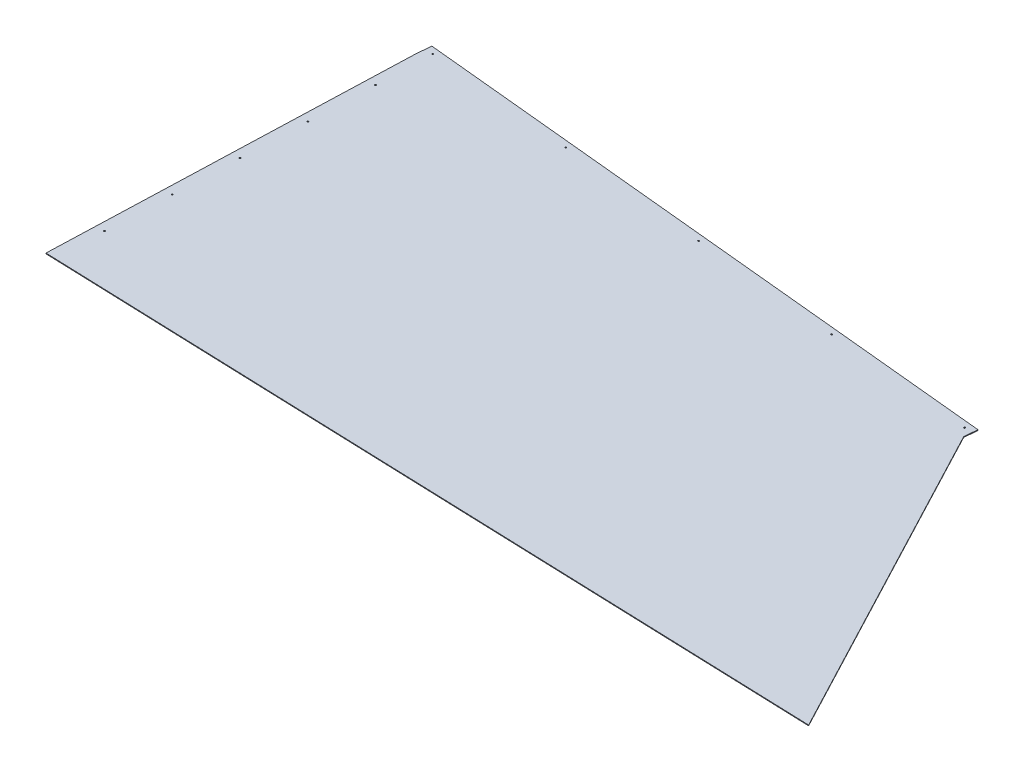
ISO-10303-21;
HEADER;
FILE_DESCRIPTION(('STEP AP214'),'2;1');
FILE_NAME('part.step','',(''),(''),'','','');
FILE_SCHEMA(('AUTOMOTIVE_DESIGN { 1 0 10303 214 1 1 1 1 }'));
ENDSEC;
DATA;
#1=APPLICATION_CONTEXT('core data for automotive mechanical design processes');
#2=APPLICATION_PROTOCOL_DEFINITION('international standard','automotive_design',2000,#1);
#3=PRODUCT_CONTEXT('',#1,'mechanical');
#4=PRODUCT('Part','Part','',(#3));
#5=PRODUCT_RELATED_PRODUCT_CATEGORY('part','',(#4));
#6=PRODUCT_DEFINITION_FORMATION('','',#4);
#7=PRODUCT_DEFINITION_CONTEXT('part definition',#1,'design');
#8=PRODUCT_DEFINITION('design','',#6,#7);
#9=PRODUCT_DEFINITION_SHAPE('','',#8);
#10=(LENGTH_UNIT() NAMED_UNIT(*) SI_UNIT(.MILLI.,.METRE.));
#11=(NAMED_UNIT(*) PLANE_ANGLE_UNIT() SI_UNIT($,.RADIAN.));
#12=(NAMED_UNIT(*) SI_UNIT($,.STERADIAN.) SOLID_ANGLE_UNIT());
#13=UNCERTAINTY_MEASURE_WITH_UNIT(LENGTH_MEASURE(1.E-05),#10,'distance_accuracy_value','');
#14=(GEOMETRIC_REPRESENTATION_CONTEXT(3) GLOBAL_UNCERTAINTY_ASSIGNED_CONTEXT((#13)) GLOBAL_UNIT_ASSIGNED_CONTEXT((#10,
#11,#12)) REPRESENTATION_CONTEXT('',''));
#15=CARTESIAN_POINT('',(0.,0.,0.));
#16=DIRECTION('',(0.,0.,1.));
#17=DIRECTION('',(1.,0.,0.));
#18=AXIS2_PLACEMENT_3D('',#15,#16,#17);
#19=CARTESIAN_POINT('',(828.090691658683,-2.53999999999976,-1276.24917351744));
#20=DIRECTION('',(0.,1.,0.));
#21=DIRECTION('',(-0.995256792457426,0.,-0.0972826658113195));
#22=AXIS2_PLACEMENT_3D('',#19,#20,#21);
#23=CYLINDRICAL_SURFACE('',#22,1.58749999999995);
#24=CARTESIAN_POINT('',(828.090691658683,2.22044604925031E-13,-1276.24917351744));
#25=DIRECTION('',(0.,1.,0.));
#26=DIRECTION('',(-0.995256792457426,0.,-0.0972826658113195));
#27=AXIS2_PLACEMENT_3D('',#24,#25,#26);
#28=CIRCLE('',#27,1.58749999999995);
#29=CARTESIAN_POINT('',(826.510721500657,2.24203641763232E-13,-1276.40360974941));
#30=VERTEX_POINT('',#29);
#31=EDGE_CURVE('E198',#30,#30,#28,.T.);
#32=ORIENTED_EDGE('',*,*,#31,.T.);
#33=EDGE_LOOP('',(#32));
#34=FACE_BOUND('',#33,.T.);
#35=CARTESIAN_POINT('',(828.090691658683,-1.62559999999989,-1276.24917351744));
#36=DIRECTION('',(0.,1.,0.));
#37=DIRECTION('',(-0.995256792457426,0.,-0.0972826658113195));
#38=AXIS2_PLACEMENT_3D('',#35,#36,#37);
#39=CIRCLE('',#38,1.58749999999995);
#40=CARTESIAN_POINT('',(826.510721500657,-1.62559999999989,-1276.40360974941));
#41=VERTEX_POINT('',#40);
#42=EDGE_CURVE('E109',#41,#41,#39,.T.);
#43=ORIENTED_EDGE('',*,*,#42,.F.);
#44=EDGE_LOOP('',(#43));
#45=FACE_BOUND('',#44,.T.);
#46=ADVANCED_FACE('F99',(#34,#45),#23,.F.);
#47=CARTESIAN_POINT('',(1156.72448452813,-2.54000000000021,-1244.12643726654));
#48=DIRECTION('',(0.,1.,0.));
#49=DIRECTION('',(-0.995256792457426,0.,-0.0972826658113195));
#50=AXIS2_PLACEMENT_3D('',#47,#48,#49);
#51=CYLINDRICAL_SURFACE('',#50,1.58750000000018);
#52=CARTESIAN_POINT('',(1156.72448452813,-2.22044604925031E-13,-1244.12643726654));
#53=DIRECTION('',(0.,1.,0.));
#54=DIRECTION('',(-0.995256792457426,0.,-0.0972826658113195));
#55=AXIS2_PLACEMENT_3D('',#52,#53,#54);
#56=CIRCLE('',#55,1.58750000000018);
#57=CARTESIAN_POINT('',(1155.1445143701,-2.1988556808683E-13,-1244.28087349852));
#58=VERTEX_POINT('',#57);
#59=EDGE_CURVE('E234',#58,#58,#56,.T.);
#60=ORIENTED_EDGE('',*,*,#59,.T.);
#61=EDGE_LOOP('',(#60));
#62=FACE_BOUND('',#61,.T.);
#63=CARTESIAN_POINT('',(1156.72448452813,-1.62560000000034,-1244.12643726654));
#64=DIRECTION('',(0.,1.,0.));
#65=DIRECTION('',(-0.995256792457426,0.,-0.0972826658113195));
#66=AXIS2_PLACEMENT_3D('',#63,#64,#65);
#67=CIRCLE('',#66,1.58750000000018);
#68=CARTESIAN_POINT('',(1155.1445143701,-1.62560000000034,-1244.28087349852));
#69=VERTEX_POINT('',#68);
#70=EDGE_CURVE('E203',#69,#69,#67,.T.);
#71=ORIENTED_EDGE('',*,*,#70,.F.);
#72=EDGE_LOOP('',(#71));
#73=FACE_BOUND('',#72,.T.);
#74=ADVANCED_FACE('F267',(#62,#73),#51,.F.);
#75=CARTESIAN_POINT('',(1485.35827739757,-2.54000000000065,-1212.00370101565));
#76=DIRECTION('',(0.,1.,0.));
#77=DIRECTION('',(-0.995256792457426,0.,-0.0972826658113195));
#78=AXIS2_PLACEMENT_3D('',#75,#76,#77);
#79=CYLINDRICAL_SURFACE('',#78,1.58749999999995);
#80=CARTESIAN_POINT('',(1485.35827739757,-4.44089209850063E-13,-1212.00370101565));
#81=DIRECTION('',(0.,1.,0.));
#82=DIRECTION('',(-0.995256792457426,0.,-0.0972826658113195));
#83=AXIS2_PLACEMENT_3D('',#80,#81,#82);
#84=CIRCLE('',#83,1.58749999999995);
#85=CARTESIAN_POINT('',(1483.77830723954,-4.41930173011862E-13,-1212.15813724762));
#86=VERTEX_POINT('',#85);
#87=EDGE_CURVE('E231',#86,#86,#84,.T.);
#88=ORIENTED_EDGE('',*,*,#87,.T.);
#89=EDGE_LOOP('',(#88));
#90=FACE_BOUND('',#89,.T.);
#91=CARTESIAN_POINT('',(1485.35827739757,-1.62560000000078,-1212.00370101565));
#92=DIRECTION('',(0.,1.,0.));
#93=DIRECTION('',(-0.995256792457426,0.,-0.0972826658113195));
#94=AXIS2_PLACEMENT_3D('',#91,#92,#93);
#95=CIRCLE('',#94,1.58749999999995);
#96=CARTESIAN_POINT('',(1483.77830723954,-1.62560000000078,-1212.15813724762));
#97=VERTEX_POINT('',#96);
#98=EDGE_CURVE('E206',#97,#97,#95,.T.);
#99=ORIENTED_EDGE('',*,*,#98,.F.);
#100=EDGE_LOOP('',(#99));
#101=FACE_BOUND('',#100,.T.);
#102=ADVANCED_FACE('F273',(#90,#101),#79,.F.);
#103=CARTESIAN_POINT('',(1813.99207026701,-2.54000000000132,-1179.88096476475));
#104=DIRECTION('',(0.,1.,0.));
#105=DIRECTION('',(-0.995256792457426,0.,-0.0972826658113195));
#106=AXIS2_PLACEMENT_3D('',#103,#104,#105);
#107=CYLINDRICAL_SURFACE('',#106,1.58749999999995);
#108=CARTESIAN_POINT('',(1813.99207026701,-1.33226762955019E-12,-1179.88096476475));
#109=DIRECTION('',(0.,1.,0.));
#110=DIRECTION('',(-0.995256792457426,0.,-0.0972826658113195));
#111=AXIS2_PLACEMENT_3D('',#108,#109,#110);
#112=CIRCLE('',#111,1.58749999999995);
#113=CARTESIAN_POINT('',(1812.41210010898,-1.33010859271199E-12,-1180.03540099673));
#114=VERTEX_POINT('',#113);
#115=EDGE_CURVE('E228',#114,#114,#112,.T.);
#116=ORIENTED_EDGE('',*,*,#115,.T.);
#117=EDGE_LOOP('',(#116));
#118=FACE_BOUND('',#117,.T.);
#119=CARTESIAN_POINT('',(1813.99207026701,-1.62560000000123,-1179.88096476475));
#120=DIRECTION('',(0.,1.,0.));
#121=DIRECTION('',(-0.995256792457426,0.,-0.0972826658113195));
#122=AXIS2_PLACEMENT_3D('',#119,#120,#121);
#123=CIRCLE('',#122,1.58749999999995);
#124=CARTESIAN_POINT('',(1812.41210010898,-1.62560000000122,-1180.03540099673));
#125=VERTEX_POINT('',#124);
#126=EDGE_CURVE('E209',#125,#125,#123,.T.);
#127=ORIENTED_EDGE('',*,*,#126,.F.);
#128=EDGE_LOOP('',(#127));
#129=FACE_BOUND('',#128,.T.);
#130=ADVANCED_FACE('F282',(#118,#129),#107,.F.);
#131=CARTESIAN_POINT('',(2142.62586313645,-2.54000000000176,-1147.75822851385));
#132=DIRECTION('',(0.,1.,0.));
#133=DIRECTION('',(-0.995256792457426,0.,-0.0972826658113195));
#134=AXIS2_PLACEMENT_3D('',#131,#132,#133);
#135=CYLINDRICAL_SURFACE('',#134,1.58750000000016);
#136=CARTESIAN_POINT('',(2142.62586313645,-1.99840144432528E-12,-1147.75822851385));
#137=DIRECTION('',(0.,1.,0.));
#138=DIRECTION('',(-0.995256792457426,0.,-0.0972826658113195));
#139=AXIS2_PLACEMENT_3D('',#136,#137,#138);
#140=CIRCLE('',#139,1.58750000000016);
#141=CARTESIAN_POINT('',(2141.04589297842,-1.99624240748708E-12,-1147.91266474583));
#142=VERTEX_POINT('',#141);
#143=EDGE_CURVE('E225',#142,#142,#140,.T.);
#144=ORIENTED_EDGE('',*,*,#143,.T.);
#145=EDGE_LOOP('',(#144));
#146=FACE_BOUND('',#145,.T.);
#147=CARTESIAN_POINT('',(2142.62586313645,-1.62560000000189,-1147.75822851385));
#148=DIRECTION('',(0.,1.,0.));
#149=DIRECTION('',(-0.995256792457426,0.,-0.0972826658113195));
#150=AXIS2_PLACEMENT_3D('',#147,#148,#149);
#151=CIRCLE('',#150,1.58750000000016);
#152=CARTESIAN_POINT('',(2141.04589297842,-1.62560000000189,-1147.91266474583));
#153=VERTEX_POINT('',#152);
#154=EDGE_CURVE('E212',#153,#153,#151,.T.);
#155=ORIENTED_EDGE('',*,*,#154,.F.);
#156=EDGE_LOOP('',(#155));
#157=FACE_BOUND('',#156,.T.);
#158=ADVANCED_FACE('F264',(#146,#157),#135,.F.);
#159=CARTESIAN_POINT('',(2192.56312068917,-2724.48951328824,-1155.63757233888));
#160=DIRECTION('',(0.0972826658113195,0.,-0.995256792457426));
#161=DIRECTION('',(-0.995256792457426,0.,-0.0972826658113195));
#162=AXIS2_PLACEMENT_3D('',#159,#160,#161);
#163=PLANE('',#162);
#164=DIRECTION('',(0.,1.,0.));
#165=VECTOR('',#164,1.);
#166=CARTESIAN_POINT('',(812.044790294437,-2724.48951328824,-1290.57812677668));
#167=LINE('',#166,#165);
#168=CARTESIAN_POINT('',(812.04479029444,-1.62559999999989,-1290.57812677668));
#169=VERTEX_POINT('',#168);
#170=CARTESIAN_POINT('',(812.04479029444,-4.44089209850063E-13,-1290.57812677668));
#171=VERTEX_POINT('',#170);
#172=EDGE_CURVE('E223',#169,#171,#167,.T.);
#173=ORIENTED_EDGE('',*,*,#172,.T.);
#174=DIRECTION('',(0.995256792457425,0.,0.0972826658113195));
#175=VECTOR('',#174,1.);
#176=CARTESIAN_POINT('',(2192.56312068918,-1.55431223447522E-12,-1155.63757233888));
#177=LINE('',#176,#175);
#178=CARTESIAN_POINT('',(2161.24102473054,-1.77635683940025E-12,-1158.69919122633));
#179=VERTEX_POINT('',#178);
#180=EDGE_CURVE('E221',#171,#179,#177,.T.);
#181=ORIENTED_EDGE('',*,*,#180,.T.);
#182=DIRECTION('',(0.,1.,0.));
#183=VECTOR('',#182,1.);
#184=CARTESIAN_POINT('',(2161.24102473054,-2724.48951328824,-1158.69919122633));
#185=LINE('',#184,#183);
#186=CARTESIAN_POINT('',(2161.24102473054,-1.62560000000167,-1158.69919122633));
#187=VERTEX_POINT('',#186);
#188=EDGE_CURVE('E128',#187,#179,#185,.T.);
#189=ORIENTED_EDGE('',*,*,#188,.F.);
#190=DIRECTION('',(-0.995256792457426,0.,-0.0972826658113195));
#191=VECTOR('',#190,1.);
#192=CARTESIAN_POINT('',(2192.56312068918,-1.62560000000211,-1155.63757233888));
#193=LINE('',#192,#191);
#194=EDGE_CURVE('E117',#187,#169,#193,.T.);
#195=ORIENTED_EDGE('',*,*,#194,.T.);
#196=EDGE_LOOP('',(#173,#181,#189,#195));
#197=FACE_BOUND('',#196,.T.);
#198=ADVANCED_FACE('F255',(#197),#163,.T.);
#199=CARTESIAN_POINT('',(808.956065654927,-2724.48951328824,-1258.97872361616));
#200=DIRECTION('',(0.995256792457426,0.,0.0972826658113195));
#201=DIRECTION('',(0.0972826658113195,0.,-0.995256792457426));
#202=AXIS2_PLACEMENT_3D('',#199,#200,#201);
#203=PLANE('',#202);
#204=DIRECTION('',(-0.0972826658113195,0.,0.995256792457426));
#205=VECTOR('',#204,1.);
#206=CARTESIAN_POINT('',(808.956065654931,-2.22044604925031E-13,-1258.97872361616));
#207=LINE('',#206,#205);
#208=CARTESIAN_POINT('',(809.057878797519,-1.15142270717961E-13,-1260.02032975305));
#209=VERTEX_POINT('',#208);
#210=EDGE_CURVE('E136',#171,#209,#207,.T.);
#211=ORIENTED_EDGE('',*,*,#210,.F.);
#212=ORIENTED_EDGE('',*,*,#172,.F.);
#213=DIRECTION('',(0.0972826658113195,0.,-0.995256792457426));
#214=VECTOR('',#213,1.);
#215=CARTESIAN_POINT('',(808.956065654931,-1.62560000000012,-1258.97872361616));
#216=LINE('',#215,#214);
#217=CARTESIAN_POINT('',(809.057878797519,-1.62560000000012,-1260.02032975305));
#218=VERTEX_POINT('',#217);
#219=EDGE_CURVE('E13',#218,#169,#216,.T.);
#220=ORIENTED_EDGE('',*,*,#219,.F.);
#221=DIRECTION('',(0.,-1.,0.));
#222=VECTOR('',#221,1.);
#223=CARTESIAN_POINT('',(809.057878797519,-0.812800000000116,-1260.02032975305));
#224=LINE('',#223,#222);
#225=EDGE_CURVE('E174',#209,#218,#224,.T.);
#226=ORIENTED_EDGE('',*,*,#225,.F.);
#227=EDGE_LOOP('',(#211,#212,#220,#226));
#228=FACE_BOUND('',#227,.T.);
#229=ADVANCED_FACE('F256',(#228),#203,.F.);
#230=CARTESIAN_POINT('',(129.55176663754,8.88178419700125E-13,-1325.38797786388));
#231=DIRECTION('',(0.,1.,0.));
#232=DIRECTION('',(-0.995256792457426,0.,-0.0972826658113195));
#233=AXIS2_PLACEMENT_3D('',#230,#231,#232);
#234=PLANE('',#233);
#235=ORIENTED_EDGE('',*,*,#210,.T.);
#236=DIRECTION('',(0.0347389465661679,0.,-0.999396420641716));
#237=VECTOR('',#236,1.);
#238=CARTESIAN_POINT('',(809.001296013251,-1.14708589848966E-13,-1258.39251320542));
#239=LINE('',#238,#237);
#240=CARTESIAN_POINT('',(781.286136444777,0.,-461.061735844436));
#241=VERTEX_POINT('',#240);
#242=EDGE_CURVE('E184',#241,#209,#239,.T.);
#243=ORIENTED_EDGE('',*,*,#242,.F.);
#244=DIRECTION('',(0.999396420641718,0.,0.0347389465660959));
#245=VECTOR('',#244,1.);
#246=CARTESIAN_POINT('',(2571.71966629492,0.,-398.82639715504));
#247=LINE('',#246,#245);
#248=CARTESIAN_POINT('',(2542.48326093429,0.,-399.842652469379));
#249=VERTEX_POINT('',#248);
#250=EDGE_CURVE('E183',#241,#249,#247,.T.);
#251=ORIENTED_EDGE('',*,*,#250,.T.);
#252=DIRECTION('',(0.46565562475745,0.,0.884966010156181));
#253=VECTOR('',#252,1.);
#254=CARTESIAN_POINT('',(2158.41225593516,-1.08203376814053E-13,-1129.75928364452));
#255=LINE('',#254,#253);
#256=CARTESIAN_POINT('',(2158.41225593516,-1.0842021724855E-13,-1129.75928364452));
#257=VERTEX_POINT('',#256);
#258=EDGE_CURVE('E158',#257,#249,#255,.T.);
#259=ORIENTED_EDGE('',*,*,#258,.F.);
#260=DIRECTION('',(-0.0972826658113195,0.,0.995256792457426));
#261=VECTOR('',#260,1.);
#262=CARTESIAN_POINT('',(2158.15230009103,-1.99840144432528E-12,-1127.09978806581));
#263=LINE('',#262,#261);
#264=EDGE_CURVE('E217',#179,#257,#263,.T.);
#265=ORIENTED_EDGE('',*,*,#264,.F.);
#266=ORIENTED_EDGE('',*,*,#180,.F.);
#267=EDGE_LOOP('',(#235,#243,#251,#259,#265,#266));
#268=FACE_BOUND('',#267,.T.);
#269=ORIENTED_EDGE('',*,*,#143,.F.);
#270=EDGE_LOOP('',(#269));
#271=FACE_BOUND('',#270,.T.);
#272=ORIENTED_EDGE('',*,*,#115,.F.);
#273=EDGE_LOOP('',(#272));
#274=FACE_BOUND('',#273,.T.);
#275=ORIENTED_EDGE('',*,*,#87,.F.);
#276=EDGE_LOOP('',(#275));
#277=FACE_BOUND('',#276,.T.);
#278=ORIENTED_EDGE('',*,*,#59,.F.);
#279=EDGE_LOOP('',(#278));
#280=FACE_BOUND('',#279,.T.);
#281=ORIENTED_EDGE('',*,*,#31,.F.);
#282=EDGE_LOOP('',(#281));
#283=FACE_BOUND('',#282,.T.);
#284=CARTESIAN_POINT('',(804.091554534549,0.,-568.769469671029));
#285=DIRECTION('',(0.,1.,0.));
#286=DIRECTION('',(-1.,0.,0.));
#287=AXIS2_PLACEMENT_3D('',#284,#285,#286);
#288=CIRCLE('',#287,1.58749999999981);
#289=CARTESIAN_POINT('',(802.50405453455,0.,-568.769469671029));
#290=VERTEX_POINT('',#289);
#291=EDGE_CURVE('E527',#290,#290,#288,.F.);
#292=ORIENTED_EDGE('',*,*,#291,.T.);
#293=EDGE_LOOP('',(#292));
#294=FACE_BOUND('',#293,.T.);
#295=CARTESIAN_POINT('',(809.165177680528,0.,-714.731316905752));
#296=DIRECTION('',(0.,1.,0.));
#297=DIRECTION('',(-1.,0.,0.));
#298=AXIS2_PLACEMENT_3D('',#295,#296,#297);
#299=CIRCLE('',#298,1.58749999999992);
#300=CARTESIAN_POINT('',(807.577677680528,0.,-714.731316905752));
#301=VERTEX_POINT('',#300);
#302=EDGE_CURVE('E524',#301,#301,#299,.F.);
#303=ORIENTED_EDGE('',*,*,#302,.T.);
#304=EDGE_LOOP('',(#303));
#305=FACE_BOUND('',#304,.T.);
#306=CARTESIAN_POINT('',(814.238800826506,0.,-860.693164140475));
#307=DIRECTION('',(0.,1.,0.));
#308=DIRECTION('',(-1.,0.,0.));
#309=AXIS2_PLACEMENT_3D('',#306,#307,#308);
#310=CIRCLE('',#309,1.58749999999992);
#311=CARTESIAN_POINT('',(812.651300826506,0.,-860.693164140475));
#312=VERTEX_POINT('',#311);
#313=EDGE_CURVE('E519',#312,#312,#310,.F.);
#314=ORIENTED_EDGE('',*,*,#313,.T.);
#315=EDGE_LOOP('',(#314));
#316=FACE_BOUND('',#315,.T.);
#317=CARTESIAN_POINT('',(819.312423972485,0.,-1006.6550113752));
#318=DIRECTION('',(0.,1.,0.));
#319=DIRECTION('',(-1.,0.,0.));
#320=AXIS2_PLACEMENT_3D('',#317,#318,#319);
#321=CIRCLE('',#320,1.58749999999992);
#322=CARTESIAN_POINT('',(817.724923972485,0.,-1006.6550113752));
#323=VERTEX_POINT('',#322);
#324=EDGE_CURVE('E516',#323,#323,#321,.F.);
#325=ORIENTED_EDGE('',*,*,#324,.T.);
#326=EDGE_LOOP('',(#325));
#327=FACE_BOUND('',#326,.T.);
#328=CARTESIAN_POINT('',(824.386047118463,0.,-1152.61685860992));
#329=DIRECTION('',(0.,1.,0.));
#330=DIRECTION('',(-1.,0.,0.));
#331=AXIS2_PLACEMENT_3D('',#328,#329,#330);
#332=CIRCLE('',#331,1.5874999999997);
#333=CARTESIAN_POINT('',(822.798547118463,0.,-1152.61685860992));
#334=VERTEX_POINT('',#333);
#335=EDGE_CURVE('E250',#334,#334,#332,.F.);
#336=ORIENTED_EDGE('',*,*,#335,.T.);
#337=EDGE_LOOP('',(#336));
#338=FACE_BOUND('',#337,.T.);
#339=ADVANCED_FACE('F247',(#268,#271,#274,#277,#280,#283,#294,#305,#316,#327,#338),#234,.T.);
#340=CARTESIAN_POINT('',(2158.15230009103,-2724.48951328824,-1127.09978806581));
#341=DIRECTION('',(-0.995256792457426,0.,-0.0972826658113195));
#342=DIRECTION('',(-0.0972826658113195,0.,0.995256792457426));
#343=AXIS2_PLACEMENT_3D('',#340,#341,#342);
#344=PLANE('',#343);
#345=ORIENTED_EDGE('',*,*,#264,.T.);
#346=DIRECTION('',(0.,-1.,0.));
#347=VECTOR('',#346,1.);
#348=CARTESIAN_POINT('',(2158.41225593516,-0.812800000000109,-1129.75928364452));
#349=LINE('',#348,#347);
#350=CARTESIAN_POINT('',(2158.41225593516,-1.62560000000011,-1129.75928364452));
#351=VERTEX_POINT('',#350);
#352=EDGE_CURVE('E199',#257,#351,#349,.T.);
#353=ORIENTED_EDGE('',*,*,#352,.T.);
#354=DIRECTION('',(0.0972826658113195,0.,-0.995256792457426));
#355=VECTOR('',#354,1.);
#356=CARTESIAN_POINT('',(2158.15230009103,-1.62560000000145,-1127.09978806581));
#357=LINE('',#356,#355);
#358=EDGE_CURVE('E141',#351,#187,#357,.T.);
#359=ORIENTED_EDGE('',*,*,#358,.T.);
#360=ORIENTED_EDGE('',*,*,#188,.T.);
#361=EDGE_LOOP('',(#345,#353,#359,#360));
#362=FACE_BOUND('',#361,.T.);
#363=ADVANCED_FACE('F253',(#362),#344,.F.);
#364=CARTESIAN_POINT('',(0.,-1.6256,0.));
#365=DIRECTION('',(0.,1.,0.));
#366=DIRECTION('',(-1.,0.,0.));
#367=AXIS2_PLACEMENT_3D('',#364,#365,#366);
#368=PLANE('',#367);
#369=ORIENTED_EDGE('',*,*,#154,.T.);
#370=EDGE_LOOP('',(#369));
#371=FACE_BOUND('',#370,.T.);
#372=ORIENTED_EDGE('',*,*,#126,.T.);
#373=EDGE_LOOP('',(#372));
#374=FACE_BOUND('',#373,.T.);
#375=ORIENTED_EDGE('',*,*,#98,.T.);
#376=EDGE_LOOP('',(#375));
#377=FACE_BOUND('',#376,.T.);
#378=ORIENTED_EDGE('',*,*,#70,.T.);
#379=EDGE_LOOP('',(#378));
#380=FACE_BOUND('',#379,.T.);
#381=ORIENTED_EDGE('',*,*,#42,.T.);
#382=EDGE_LOOP('',(#381));
#383=FACE_BOUND('',#382,.T.);
#384=ORIENTED_EDGE('',*,*,#358,.F.);
#385=DIRECTION('',(0.46565562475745,0.,0.884966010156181));
#386=VECTOR('',#385,1.);
#387=CARTESIAN_POINT('',(2158.41225593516,-1.62560000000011,-1129.75928364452));
#388=LINE('',#387,#386);
#389=CARTESIAN_POINT('',(2542.48326093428,-1.62560000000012,-399.842652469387));
#390=VERTEX_POINT('',#389);
#391=EDGE_CURVE('E176',#351,#390,#388,.T.);
#392=ORIENTED_EDGE('',*,*,#391,.T.);
#393=DIRECTION('',(0.999396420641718,0.,0.0347389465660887));
#394=VECTOR('',#393,1.);
#395=CARTESIAN_POINT('',(-2552.7,-1.62560000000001,-576.950850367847));
#396=LINE('',#395,#394);
#397=CARTESIAN_POINT('',(781.286136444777,-1.6256,-461.061735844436));
#398=VERTEX_POINT('',#397);
#399=EDGE_CURVE('E182',#398,#390,#396,.T.);
#400=ORIENTED_EDGE('',*,*,#399,.F.);
#401=DIRECTION('',(0.0347389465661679,0.,-0.999396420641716));
#402=VECTOR('',#401,1.);
#403=CARTESIAN_POINT('',(809.001296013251,-1.62560000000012,-1258.39251320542));
#404=LINE('',#403,#402);
#405=EDGE_CURVE('E169',#398,#218,#404,.T.);
#406=ORIENTED_EDGE('',*,*,#405,.T.);
#407=ORIENTED_EDGE('',*,*,#219,.T.);
#408=ORIENTED_EDGE('',*,*,#194,.F.);
#409=EDGE_LOOP('',(#384,#392,#400,#406,#407,#408));
#410=FACE_BOUND('',#409,.T.);
#411=CARTESIAN_POINT('',(824.386047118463,-1.6256,-1152.61685860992));
#412=DIRECTION('',(0.,-1.,0.));
#413=DIRECTION('',(1.,0.,0.));
#414=AXIS2_PLACEMENT_3D('',#411,#412,#413);
#415=CIRCLE('',#414,1.5874999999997);
#416=CARTESIAN_POINT('',(825.973547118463,-1.6256,-1152.61685860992));
#417=VERTEX_POINT('',#416);
#418=EDGE_CURVE('E512',#417,#417,#415,.T.);
#419=ORIENTED_EDGE('',*,*,#418,.F.);
#420=EDGE_LOOP('',(#419));
#421=FACE_BOUND('',#420,.T.);
#422=CARTESIAN_POINT('',(819.312423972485,-1.6256,-1006.6550113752));
#423=DIRECTION('',(0.,-1.,0.));
#424=DIRECTION('',(1.,0.,0.));
#425=AXIS2_PLACEMENT_3D('',#422,#423,#424);
#426=CIRCLE('',#425,1.58749999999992);
#427=CARTESIAN_POINT('',(820.899923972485,-1.6256,-1006.6550113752));
#428=VERTEX_POINT('',#427);
#429=EDGE_CURVE('E531',#428,#428,#426,.T.);
#430=ORIENTED_EDGE('',*,*,#429,.F.);
#431=EDGE_LOOP('',(#430));
#432=FACE_BOUND('',#431,.T.);
#433=CARTESIAN_POINT('',(814.238800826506,-1.6256,-860.693164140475));
#434=DIRECTION('',(0.,-1.,0.));
#435=DIRECTION('',(1.,0.,0.));
#436=AXIS2_PLACEMENT_3D('',#433,#434,#435);
#437=CIRCLE('',#436,1.58749999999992);
#438=CARTESIAN_POINT('',(815.826300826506,-1.6256,-860.693164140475));
#439=VERTEX_POINT('',#438);
#440=EDGE_CURVE('E534',#439,#439,#437,.T.);
#441=ORIENTED_EDGE('',*,*,#440,.F.);
#442=EDGE_LOOP('',(#441));
#443=FACE_BOUND('',#442,.T.);
#444=CARTESIAN_POINT('',(809.165177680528,-1.6256,-714.731316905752));
#445=DIRECTION('',(0.,-1.,0.));
#446=DIRECTION('',(1.,0.,0.));
#447=AXIS2_PLACEMENT_3D('',#444,#445,#446);
#448=CIRCLE('',#447,1.58749999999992);
#449=CARTESIAN_POINT('',(810.752677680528,-1.6256,-714.731316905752));
#450=VERTEX_POINT('',#449);
#451=EDGE_CURVE('E192',#450,#450,#448,.T.);
#452=ORIENTED_EDGE('',*,*,#451,.F.);
#453=EDGE_LOOP('',(#452));
#454=FACE_BOUND('',#453,.T.);
#455=CARTESIAN_POINT('',(804.091554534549,-1.6256,-568.769469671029));
#456=DIRECTION('',(0.,-1.,0.));
#457=DIRECTION('',(1.,0.,0.));
#458=AXIS2_PLACEMENT_3D('',#455,#456,#457);
#459=CIRCLE('',#458,1.58749999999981);
#460=CARTESIAN_POINT('',(805.679054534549,-1.6256,-568.769469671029));
#461=VERTEX_POINT('',#460);
#462=EDGE_CURVE('E188',#461,#461,#459,.T.);
#463=ORIENTED_EDGE('',*,*,#462,.F.);
#464=EDGE_LOOP('',(#463));
#465=FACE_BOUND('',#464,.T.);
#466=ADVANCED_FACE('F101',(#371,#374,#377,#380,#383,#410,#421,#432,#443,#454,#465),#368,.F.);
#467=CARTESIAN_POINT('',(809.001296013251,-0.812800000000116,-1258.39251320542));
#468=DIRECTION('',(-0.999396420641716,0.,-0.0347389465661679));
#469=DIRECTION('',(0.0347389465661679,0.,-0.999396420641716));
#470=AXIS2_PLACEMENT_3D('',#467,#468,#469);
#471=PLANE('',#470);
#472=ORIENTED_EDGE('',*,*,#405,.F.);
#473=DIRECTION('',(0.,1.,0.));
#474=VECTOR('',#473,1.);
#475=CARTESIAN_POINT('',(781.286136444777,-3920.25963480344,-461.061735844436));
#476=LINE('',#475,#474);
#477=EDGE_CURVE('E173',#398,#241,#476,.T.);
#478=ORIENTED_EDGE('',*,*,#477,.T.);
#479=ORIENTED_EDGE('',*,*,#242,.T.);
#480=ORIENTED_EDGE('',*,*,#225,.T.);
#481=EDGE_LOOP('',(#472,#478,#479,#480));
#482=FACE_BOUND('',#481,.T.);
#483=ADVANCED_FACE('F171',(#482),#471,.T.);
#484=CARTESIAN_POINT('',(2158.41225593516,-0.812800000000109,-1129.75928364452));
#485=DIRECTION('',(0.88496601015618,0.,-0.46565562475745));
#486=DIRECTION('',(0.46565562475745,0.,0.884966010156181));
#487=AXIS2_PLACEMENT_3D('',#484,#485,#486);
#488=PLANE('',#487);
#489=ORIENTED_EDGE('',*,*,#258,.T.);
#490=DIRECTION('',(0.,1.,0.));
#491=VECTOR('',#490,1.);
#492=CARTESIAN_POINT('',(2542.48326093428,-3920.25963480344,-399.842652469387));
#493=LINE('',#492,#491);
#494=EDGE_CURVE('E189',#390,#249,#493,.T.);
#495=ORIENTED_EDGE('',*,*,#494,.F.);
#496=ORIENTED_EDGE('',*,*,#391,.F.);
#497=ORIENTED_EDGE('',*,*,#352,.F.);
#498=EDGE_LOOP('',(#489,#495,#496,#497));
#499=FACE_BOUND('',#498,.T.);
#500=ADVANCED_FACE('F252',(#499),#488,.T.);
#501=CARTESIAN_POINT('',(-2552.7,-3920.25963480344,-576.950850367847));
#502=DIRECTION('',(-0.0347389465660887,0.,0.999396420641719));
#503=DIRECTION('',(0.999396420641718,0.,0.0347389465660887));
#504=AXIS2_PLACEMENT_3D('',#501,#502,#503);
#505=PLANE('',#504);
#506=ORIENTED_EDGE('',*,*,#494,.T.);
#507=ORIENTED_EDGE('',*,*,#250,.F.);
#508=ORIENTED_EDGE('',*,*,#477,.F.);
#509=ORIENTED_EDGE('',*,*,#399,.T.);
#510=EDGE_LOOP('',(#506,#507,#508,#509));
#511=FACE_BOUND('',#510,.T.);
#512=ADVANCED_FACE('F181',(#511),#505,.T.);
#513=CARTESIAN_POINT('',(804.091554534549,4.49012806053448,-568.769469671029));
#514=DIRECTION('',(0.,-1.,0.));
#515=DIRECTION('',(1.,0.,0.));
#516=AXIS2_PLACEMENT_3D('',#513,#514,#515);
#517=CYLINDRICAL_SURFACE('',#516,1.58749999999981);
#518=ORIENTED_EDGE('',*,*,#462,.T.);
#519=EDGE_LOOP('',(#518));
#520=FACE_BOUND('',#519,.T.);
#521=ORIENTED_EDGE('',*,*,#291,.F.);
#522=EDGE_LOOP('',(#521));
#523=FACE_BOUND('',#522,.T.);
#524=ADVANCED_FACE('F356',(#520,#523),#517,.F.);
#525=CARTESIAN_POINT('',(809.165177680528,4.49012806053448,-714.731316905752));
#526=DIRECTION('',(0.,-1.,0.));
#527=DIRECTION('',(1.,0.,0.));
#528=AXIS2_PLACEMENT_3D('',#525,#526,#527);
#529=CYLINDRICAL_SURFACE('',#528,1.58749999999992);
#530=ORIENTED_EDGE('',*,*,#451,.T.);
#531=EDGE_LOOP('',(#530));
#532=FACE_BOUND('',#531,.T.);
#533=ORIENTED_EDGE('',*,*,#302,.F.);
#534=EDGE_LOOP('',(#533));
#535=FACE_BOUND('',#534,.T.);
#536=ADVANCED_FACE('F363',(#532,#535),#529,.F.);
#537=CARTESIAN_POINT('',(814.238800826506,4.49012806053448,-860.693164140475));
#538=DIRECTION('',(0.,-1.,0.));
#539=DIRECTION('',(1.,0.,0.));
#540=AXIS2_PLACEMENT_3D('',#537,#538,#539);
#541=CYLINDRICAL_SURFACE('',#540,1.58749999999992);
#542=ORIENTED_EDGE('',*,*,#440,.T.);
#543=EDGE_LOOP('',(#542));
#544=FACE_BOUND('',#543,.T.);
#545=ORIENTED_EDGE('',*,*,#313,.F.);
#546=EDGE_LOOP('',(#545));
#547=FACE_BOUND('',#546,.T.);
#548=ADVANCED_FACE('F371',(#544,#547),#541,.F.);
#549=CARTESIAN_POINT('',(819.312423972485,4.49012806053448,-1006.6550113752));
#550=DIRECTION('',(0.,-1.,0.));
#551=DIRECTION('',(1.,0.,0.));
#552=AXIS2_PLACEMENT_3D('',#549,#550,#551);
#553=CYLINDRICAL_SURFACE('',#552,1.58749999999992);
#554=ORIENTED_EDGE('',*,*,#429,.T.);
#555=EDGE_LOOP('',(#554));
#556=FACE_BOUND('',#555,.T.);
#557=ORIENTED_EDGE('',*,*,#324,.F.);
#558=EDGE_LOOP('',(#557));
#559=FACE_BOUND('',#558,.T.);
#560=ADVANCED_FACE('F379',(#556,#559),#553,.F.);
#561=CARTESIAN_POINT('',(824.386047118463,4.49012806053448,-1152.61685860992));
#562=DIRECTION('',(0.,-1.,0.));
#563=DIRECTION('',(1.,0.,0.));
#564=AXIS2_PLACEMENT_3D('',#561,#562,#563);
#565=CYLINDRICAL_SURFACE('',#564,1.5874999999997);
#566=ORIENTED_EDGE('',*,*,#418,.T.);
#567=EDGE_LOOP('',(#566));
#568=FACE_BOUND('',#567,.T.);
#569=ORIENTED_EDGE('',*,*,#335,.F.);
#570=EDGE_LOOP('',(#569));
#571=FACE_BOUND('',#570,.T.);
#572=ADVANCED_FACE('F387',(#568,#571),#565,.F.);
#573=CLOSED_SHELL('',(#46,#74,#102,#130,#158,#198,#229,#339,#363,#466,#483,#500,#512,#524,#536,
#548,#560,#572));
#574=MANIFOLD_SOLID_BREP('B2',#573);
#575=ADVANCED_BREP_SHAPE_REPRESENTATION('',(#18,#574),#14);
#576=SHAPE_DEFINITION_REPRESENTATION(#9,#575);
ENDSEC;
END-ISO-10303-21;
